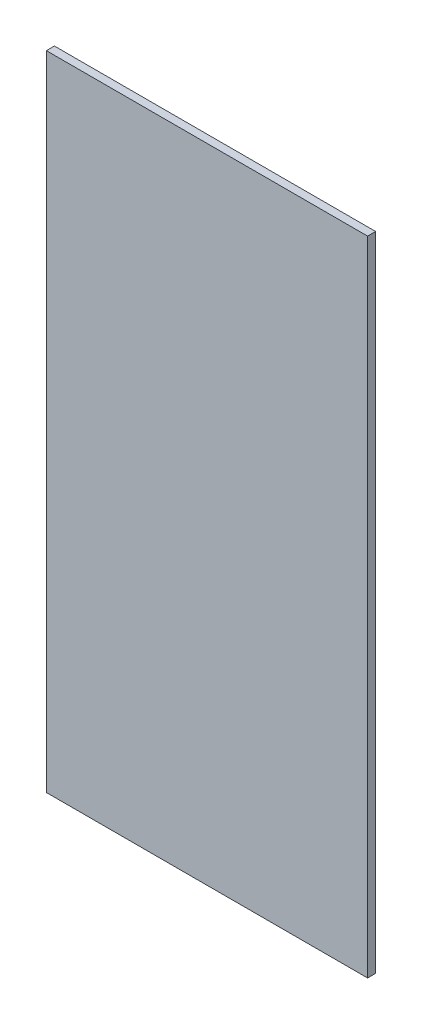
ISO-10303-21;
HEADER;
FILE_DESCRIPTION(('STEP AP214'),'2;1');
FILE_NAME('part.step','',(''),(''),'','','');
FILE_SCHEMA(('AUTOMOTIVE_DESIGN { 1 0 10303 214 1 1 1 1 }'));
ENDSEC;
DATA;
#1=APPLICATION_CONTEXT('core data for automotive mechanical design processes');
#2=APPLICATION_PROTOCOL_DEFINITION('international standard','automotive_design',2000,#1);
#3=PRODUCT_CONTEXT('',#1,'mechanical');
#4=PRODUCT('Part','Part','',(#3));
#5=PRODUCT_RELATED_PRODUCT_CATEGORY('part','',(#4));
#6=PRODUCT_DEFINITION_FORMATION('','',#4);
#7=PRODUCT_DEFINITION_CONTEXT('part definition',#1,'design');
#8=PRODUCT_DEFINITION('design','',#6,#7);
#9=PRODUCT_DEFINITION_SHAPE('','',#8);
#10=(LENGTH_UNIT() NAMED_UNIT(*) SI_UNIT(.MILLI.,.METRE.));
#11=(NAMED_UNIT(*) PLANE_ANGLE_UNIT() SI_UNIT($,.RADIAN.));
#12=(NAMED_UNIT(*) SI_UNIT($,.STERADIAN.) SOLID_ANGLE_UNIT());
#13=UNCERTAINTY_MEASURE_WITH_UNIT(LENGTH_MEASURE(1.E-05),#10,'distance_accuracy_value','');
#14=(GEOMETRIC_REPRESENTATION_CONTEXT(3) GLOBAL_UNCERTAINTY_ASSIGNED_CONTEXT((#13)) GLOBAL_UNIT_ASSIGNED_CONTEXT((#10,
#11,#12)) REPRESENTATION_CONTEXT('',''));
#15=CARTESIAN_POINT('',(0.,0.,0.));
#16=DIRECTION('',(0.,0.,1.));
#17=DIRECTION('',(1.,0.,0.));
#18=AXIS2_PLACEMENT_3D('',#15,#16,#17);
#19=CARTESIAN_POINT('',(-1007.50000000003,-1780.,-17.4999999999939));
#20=DIRECTION('',(0.,-1.,0.));
#21=DIRECTION('',(-1.,0.,0.));
#22=AXIS2_PLACEMENT_3D('',#19,#20,#21);
#23=CYLINDRICAL_SURFACE('',#22,2.5);
#24=DIRECTION('',(0.,-1.,0.));
#25=VECTOR('',#24,1.);
#26=CARTESIAN_POINT('',(-1007.50000000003,-1780.,-14.9999999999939));
#27=LINE('',#26,#25);
#28=CARTESIAN_POINT('',(-1007.50000000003,-1820.,-14.9999999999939));
#29=VERTEX_POINT('',#28);
#30=CARTESIAN_POINT('',(-1007.50000000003,-1840.,-14.9999999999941));
#31=VERTEX_POINT('',#30);
#32=EDGE_CURVE('P0_E151',#29,#31,#27,.T.);
#33=ORIENTED_EDGE('',*,*,#32,.T.);
#34=CARTESIAN_POINT('',(-1007.50000000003,-1840.,-17.4999999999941));
#35=DIRECTION('',(0.,-1.,0.));
#36=DIRECTION('',(-1.,0.,0.));
#37=AXIS2_PLACEMENT_3D('',#34,#35,#36);
#38=CIRCLE('',#37,2.5);
#39=CARTESIAN_POINT('',(-1005.50000000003,-1840.,-15.999999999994));
#40=VERTEX_POINT('',#39);
#41=EDGE_CURVE('P0_E12',#31,#40,#38,.T.);
#42=ORIENTED_EDGE('',*,*,#41,.T.);
#43=DIRECTION('',(0.,-1.,0.));
#44=VECTOR('',#43,1.);
#45=CARTESIAN_POINT('',(-1005.50000000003,-1780.,-15.9999999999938));
#46=LINE('',#45,#44);
#47=CARTESIAN_POINT('',(-1005.50000000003,-1820.,-15.9999999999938));
#48=VERTEX_POINT('',#47);
#49=EDGE_CURVE('P0_E198',#48,#40,#46,.T.);
#50=ORIENTED_EDGE('',*,*,#49,.F.);
#51=CARTESIAN_POINT('',(-1007.50000000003,-1820.,-17.4999999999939));
#52=DIRECTION('',(0.,1.,0.));
#53=DIRECTION('',(1.,0.,0.));
#54=AXIS2_PLACEMENT_3D('',#51,#52,#53);
#55=CIRCLE('',#54,2.5);
#56=EDGE_CURVE('P0_E153',#48,#29,#55,.T.);
#57=ORIENTED_EDGE('',*,*,#56,.T.);
#58=EDGE_LOOP('',(#33,#42,#50,#57));
#59=FACE_BOUND('',#58,.T.);
#60=ADVANCED_FACE('P0_F49',(#59),#23,.F.);
#61=CARTESIAN_POINT('',(-1007.50000000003,-1780.,-17.4999999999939));
#62=DIRECTION('',(0.,-1.,0.));
#63=DIRECTION('',(-1.,0.,0.));
#64=AXIS2_PLACEMENT_3D('',#61,#62,#63);
#65=CYLINDRICAL_SURFACE('',#64,5.);
#66=CARTESIAN_POINT('',(-1007.50000000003,-1820.,-17.4999999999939));
#67=DIRECTION('',(0.,1.,0.));
#68=DIRECTION('',(1.,0.,0.));
#69=AXIS2_PLACEMENT_3D('',#66,#67,#68);
#70=CIRCLE('',#69,5.);
#71=CARTESIAN_POINT('',(-1002.73030399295,-1820.,-15.9999999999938));
#72=VERTEX_POINT('',#71);
#73=CARTESIAN_POINT('',(-1007.50000000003,-1820.,-12.499999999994));
#74=VERTEX_POINT('',#73);
#75=EDGE_CURVE('P0_E152',#72,#74,#70,.T.);
#76=ORIENTED_EDGE('',*,*,#75,.F.);
#77=DIRECTION('',(0.,-1.,0.));
#78=VECTOR('',#77,1.);
#79=CARTESIAN_POINT('',(-1002.73030399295,-1780.,-15.9999999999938));
#80=LINE('',#79,#78);
#81=CARTESIAN_POINT('',(-1002.73030399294,-1860.,-15.999999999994));
#82=VERTEX_POINT('',#81);
#83=EDGE_CURVE('P0_E195',#72,#82,#80,.T.);
#84=ORIENTED_EDGE('',*,*,#83,.T.);
#85=CARTESIAN_POINT('',(-1007.50000000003,-1860.,-17.4999999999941));
#86=DIRECTION('',(0.,1.,0.));
#87=DIRECTION('',(1.,0.,0.));
#88=AXIS2_PLACEMENT_3D('',#85,#86,#87);
#89=CIRCLE('',#88,5.);
#90=CARTESIAN_POINT('',(-1007.50000000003,-1860.,-12.4999999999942));
#91=VERTEX_POINT('',#90);
#92=EDGE_CURVE('P0_E175',#82,#91,#89,.T.);
#93=ORIENTED_EDGE('',*,*,#92,.T.);
#94=DIRECTION('',(0.,-1.,0.));
#95=VECTOR('',#94,1.);
#96=CARTESIAN_POINT('',(-1007.50000000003,-1780.,-12.499999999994));
#97=LINE('',#96,#95);
#98=EDGE_CURVE('P0_E209',#74,#91,#97,.T.);
#99=ORIENTED_EDGE('',*,*,#98,.F.);
#100=EDGE_LOOP('',(#76,#84,#93,#99));
#101=FACE_BOUND('',#100,.T.);
#102=ADVANCED_FACE('P0_F220',(#101),#65,.T.);
#103=ORIENTED_EDGE('',*,*,#41,.F.);
#104=CARTESIAN_POINT('',(-1007.50000000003,-1860.,-14.9999999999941));
#105=VERTEX_POINT('',#104);
#106=EDGE_CURVE('P0_E201',#31,#105,#27,.T.);
#107=ORIENTED_EDGE('',*,*,#106,.T.);
#108=CARTESIAN_POINT('',(-1007.50000000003,-1860.,-17.4999999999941));
#109=DIRECTION('',(0.,1.,0.));
#110=DIRECTION('',(1.,0.,0.));
#111=AXIS2_PLACEMENT_3D('',#108,#109,#110);
#112=CIRCLE('',#111,2.5);
#113=CARTESIAN_POINT('',(-1005.50000000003,-1860.,-15.999999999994));
#114=VERTEX_POINT('',#113);
#115=EDGE_CURVE('P0_E170',#114,#105,#112,.T.);
#116=ORIENTED_EDGE('',*,*,#115,.F.);
#117=EDGE_CURVE('P0_E197',#40,#114,#46,.T.);
#118=ORIENTED_EDGE('',*,*,#117,.F.);
#119=EDGE_LOOP('',(#103,#107,#116,#118));
#120=FACE_BOUND('',#119,.T.);
#121=ADVANCED_FACE('P0_F222',(#120),#23,.F.);
#122=CARTESIAN_POINT('',(-1002.73030399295,-1780.,-15.9999999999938));
#123=DIRECTION('',(0.,0.,1.));
#124=DIRECTION('',(1.,0.,0.));
#125=AXIS2_PLACEMENT_3D('',#122,#123,#124);
#126=PLANE('',#125);
#127=ORIENTED_EDGE('',*,*,#83,.F.);
#128=DIRECTION('',(-1.,0.,0.));
#129=VECTOR('',#128,1.);
#130=CARTESIAN_POINT('',(-1002.73030399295,-1820.,-15.9999999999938));
#131=LINE('',#130,#129);
#132=EDGE_CURVE('P0_E58',#72,#48,#131,.T.);
#133=ORIENTED_EDGE('',*,*,#132,.T.);
#134=ORIENTED_EDGE('',*,*,#49,.T.);
#135=ORIENTED_EDGE('',*,*,#117,.T.);
#136=DIRECTION('',(-1.,0.,0.));
#137=VECTOR('',#136,1.);
#138=CARTESIAN_POINT('',(-1002.73030399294,-1860.,-15.999999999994));
#139=LINE('',#138,#137);
#140=EDGE_CURVE('P0_E211',#82,#114,#139,.T.);
#141=ORIENTED_EDGE('',*,*,#140,.F.);
#142=EDGE_LOOP('',(#127,#133,#134,#135,#141));
#143=FACE_BOUND('',#142,.T.);
#144=ADVANCED_FACE('P0_F216',(#143),#126,.T.);
#145=CARTESIAN_POINT('',(-1007.50000000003,-1900.,-17.4999999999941));
#146=DIRECTION('',(0.,1.,0.));
#147=DIRECTION('',(1.,0.,0.));
#148=AXIS2_PLACEMENT_3D('',#145,#146,#147);
#149=PLANE('',#148);
#150=DIRECTION('',(0.,0.,1.));
#151=VECTOR('',#150,1.);
#152=CARTESIAN_POINT('',(-1000.00000000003,-1900.,-48.6936528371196));
#153=LINE('',#152,#151);
#154=CARTESIAN_POINT('',(-1000.00000000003,-1900.,-14.9999999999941));
#155=VERTEX_POINT('',#154);
#156=CARTESIAN_POINT('',(-1000.00000000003,-1900.,-12.4999999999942));
#157=VERTEX_POINT('',#156);
#158=EDGE_CURVE('P0_E160',#155,#157,#153,.T.);
#159=ORIENTED_EDGE('',*,*,#158,.F.);
#160=DIRECTION('',(1.,0.,0.));
#161=VECTOR('',#160,1.);
#162=CARTESIAN_POINT('',(-1007.50000000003,-1900.,-14.9999999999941));
#163=LINE('',#162,#161);
#164=CARTESIAN_POINT('',(-947.500000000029,-1900.,-14.9999999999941));
#165=VERTEX_POINT('',#164);
#166=EDGE_CURVE('P0_E186',#155,#165,#163,.T.);
#167=ORIENTED_EDGE('',*,*,#166,.T.);
#168=DIRECTION('',(0.,0.,-1.));
#169=VECTOR('',#168,1.);
#170=CARTESIAN_POINT('',(-947.500000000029,-1900.,-12.4999999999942));
#171=LINE('',#170,#169);
#172=CARTESIAN_POINT('',(-947.500000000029,-1900.,-12.4999999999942));
#173=VERTEX_POINT('',#172);
#174=EDGE_CURVE('P0_E183',#173,#165,#171,.T.);
#175=ORIENTED_EDGE('',*,*,#174,.F.);
#176=DIRECTION('',(1.,0.,0.));
#177=VECTOR('',#176,1.);
#178=CARTESIAN_POINT('',(-1007.50000000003,-1900.,-12.4999999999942));
#179=LINE('',#178,#177);
#180=EDGE_CURVE('P0_E181',#157,#173,#179,.T.);
#181=ORIENTED_EDGE('',*,*,#180,.F.);
#182=EDGE_LOOP('',(#159,#167,#175,#181));
#183=FACE_BOUND('',#182,.T.);
#184=ADVANCED_FACE('P0_F234',(#183),#149,.F.);
#185=CARTESIAN_POINT('',(-1007.50000000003,-1780.,-12.499999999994));
#186=DIRECTION('',(0.,0.,-1.));
#187=DIRECTION('',(0.,1.,0.));
#188=AXIS2_PLACEMENT_3D('',#185,#186,#187);
#189=PLANE('',#188);
#190=DIRECTION('',(1.,0.,0.));
#191=VECTOR('',#190,1.);
#192=CARTESIAN_POINT('',(-1007.50000000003,-1780.,-12.499999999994));
#193=LINE('',#192,#191);
#194=CARTESIAN_POINT('',(-1000.00000000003,-1780.,-12.499999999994));
#195=VERTEX_POINT('',#194);
#196=CARTESIAN_POINT('',(-947.500000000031,-1780.,-12.499999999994));
#197=VERTEX_POINT('',#196);
#198=EDGE_CURVE('P0_E188',#195,#197,#193,.T.);
#199=ORIENTED_EDGE('',*,*,#198,.F.);
#200=DIRECTION('',(0.,-1.,0.));
#201=VECTOR('',#200,1.);
#202=CARTESIAN_POINT('',(-1000.00000000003,-1780.,-12.499999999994));
#203=LINE('',#202,#201);
#204=CARTESIAN_POINT('',(-1000.00000000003,-1820.,-12.499999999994));
#205=VERTEX_POINT('',#204);
#206=EDGE_CURVE('P0_E140',#195,#205,#203,.T.);
#207=ORIENTED_EDGE('',*,*,#206,.T.);
#208=DIRECTION('',(1.,0.,0.));
#209=VECTOR('',#208,1.);
#210=CARTESIAN_POINT('',(-1007.50000000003,-1820.,-12.499999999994));
#211=LINE('',#210,#209);
#212=EDGE_CURVE('P0_E147',#74,#205,#211,.T.);
#213=ORIENTED_EDGE('',*,*,#212,.F.);
#214=ORIENTED_EDGE('',*,*,#98,.T.);
#215=DIRECTION('',(1.,0.,0.));
#216=VECTOR('',#215,1.);
#217=CARTESIAN_POINT('',(-1007.50000000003,-1860.,-12.4999999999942));
#218=LINE('',#217,#216);
#219=CARTESIAN_POINT('',(-1000.00000000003,-1860.,-12.4999999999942));
#220=VERTEX_POINT('',#219);
#221=EDGE_CURVE('P0_E178',#91,#220,#218,.T.);
#222=ORIENTED_EDGE('',*,*,#221,.T.);
#223=DIRECTION('',(0.,1.,0.));
#224=VECTOR('',#223,1.);
#225=CARTESIAN_POINT('',(-1000.00000000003,-1780.,-12.499999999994));
#226=LINE('',#225,#224);
#227=EDGE_CURVE('P0_E168',#157,#220,#226,.T.);
#228=ORIENTED_EDGE('',*,*,#227,.F.);
#229=ORIENTED_EDGE('',*,*,#180,.T.);
#230=DIRECTION('',(0.,-1.,0.));
#231=VECTOR('',#230,1.);
#232=CARTESIAN_POINT('',(-947.500000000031,-1780.,-12.499999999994));
#233=LINE('',#232,#231);
#234=EDGE_CURVE('P0_E206',#197,#173,#233,.T.);
#235=ORIENTED_EDGE('',*,*,#234,.F.);
#236=EDGE_LOOP('',(#199,#207,#213,#214,#222,#228,#229,#235));
#237=FACE_BOUND('',#236,.T.);
#238=ADVANCED_FACE('P0_F51',(#237),#189,.F.);
#239=CARTESIAN_POINT('',(-947.500000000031,-1780.,-12.499999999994));
#240=DIRECTION('',(-1.,0.,0.));
#241=DIRECTION('',(0.,1.,0.));
#242=AXIS2_PLACEMENT_3D('',#239,#240,#241);
#243=PLANE('',#242);
#244=DIRECTION('',(0.,-1.,0.));
#245=VECTOR('',#244,1.);
#246=CARTESIAN_POINT('',(-947.500000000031,-1780.,-14.9999999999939));
#247=LINE('',#246,#245);
#248=CARTESIAN_POINT('',(-947.500000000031,-1780.,-14.9999999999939));
#249=VERTEX_POINT('',#248);
#250=EDGE_CURVE('P0_E203',#249,#165,#247,.T.);
#251=ORIENTED_EDGE('',*,*,#250,.F.);
#252=DIRECTION('',(0.,0.,-1.));
#253=VECTOR('',#252,1.);
#254=CARTESIAN_POINT('',(-947.500000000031,-1780.,-12.499999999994));
#255=LINE('',#254,#253);
#256=EDGE_CURVE('P0_E190',#197,#249,#255,.T.);
#257=ORIENTED_EDGE('',*,*,#256,.F.);
#258=ORIENTED_EDGE('',*,*,#234,.T.);
#259=ORIENTED_EDGE('',*,*,#174,.T.);
#260=EDGE_LOOP('',(#251,#257,#258,#259));
#261=FACE_BOUND('',#260,.T.);
#262=ADVANCED_FACE('P0_F290',(#261),#243,.F.);
#263=CARTESIAN_POINT('',(-1007.50000000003,-1780.,-14.9999999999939));
#264=DIRECTION('',(0.,0.,-1.));
#265=DIRECTION('',(0.,1.,0.));
#266=AXIS2_PLACEMENT_3D('',#263,#264,#265);
#267=PLANE('',#266);
#268=DIRECTION('',(0.,-1.,0.));
#269=VECTOR('',#268,1.);
#270=CARTESIAN_POINT('',(-1000.00000000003,-1780.,-14.9999999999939));
#271=LINE('',#270,#269);
#272=CARTESIAN_POINT('',(-1000.00000000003,-1780.,-14.9999999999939));
#273=VERTEX_POINT('',#272);
#274=CARTESIAN_POINT('',(-1000.00000000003,-1820.,-14.9999999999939));
#275=VERTEX_POINT('',#274);
#276=EDGE_CURVE('P0_E130',#273,#275,#271,.T.);
#277=ORIENTED_EDGE('',*,*,#276,.F.);
#278=DIRECTION('',(1.,0.,0.));
#279=VECTOR('',#278,1.);
#280=CARTESIAN_POINT('',(-1007.50000000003,-1780.,-14.9999999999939));
#281=LINE('',#280,#279);
#282=EDGE_CURVE('P0_E193',#273,#249,#281,.T.);
#283=ORIENTED_EDGE('',*,*,#282,.T.);
#284=ORIENTED_EDGE('',*,*,#250,.T.);
#285=ORIENTED_EDGE('',*,*,#166,.F.);
#286=DIRECTION('',(0.,1.,0.));
#287=VECTOR('',#286,1.);
#288=CARTESIAN_POINT('',(-1000.00000000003,-1780.,-14.9999999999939));
#289=LINE('',#288,#287);
#290=CARTESIAN_POINT('',(-1000.00000000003,-1860.,-14.9999999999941));
#291=VERTEX_POINT('',#290);
#292=EDGE_CURVE('P0_E165',#155,#291,#289,.T.);
#293=ORIENTED_EDGE('',*,*,#292,.T.);
#294=DIRECTION('',(1.,0.,0.));
#295=VECTOR('',#294,1.);
#296=CARTESIAN_POINT('',(-1007.50000000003,-1860.,-14.9999999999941));
#297=LINE('',#296,#295);
#298=EDGE_CURVE('P0_E173',#105,#291,#297,.T.);
#299=ORIENTED_EDGE('',*,*,#298,.F.);
#300=ORIENTED_EDGE('',*,*,#106,.F.);
#301=ORIENTED_EDGE('',*,*,#32,.F.);
#302=DIRECTION('',(1.,0.,0.));
#303=VECTOR('',#302,1.);
#304=CARTESIAN_POINT('',(-1007.50000000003,-1820.,-14.9999999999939));
#305=LINE('',#304,#303);
#306=EDGE_CURVE('P0_E144',#29,#275,#305,.T.);
#307=ORIENTED_EDGE('',*,*,#306,.T.);
#308=EDGE_LOOP('',(#277,#283,#284,#285,#293,#299,#300,#301,#307));
#309=FACE_BOUND('',#308,.T.);
#310=ADVANCED_FACE('P0_F150',(#309),#267,.T.);
#311=CARTESIAN_POINT('',(-1007.50000000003,-1780.,-17.4999999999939));
#312=DIRECTION('',(0.,1.,0.));
#313=DIRECTION('',(1.,0.,0.));
#314=AXIS2_PLACEMENT_3D('',#311,#312,#313);
#315=PLANE('',#314);
#316=DIRECTION('',(0.,0.,1.));
#317=VECTOR('',#316,1.);
#318=CARTESIAN_POINT('',(-1000.00000000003,-1780.,-48.6936528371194));
#319=LINE('',#318,#317);
#320=EDGE_CURVE('P0_E136',#273,#195,#319,.T.);
#321=ORIENTED_EDGE('',*,*,#320,.T.);
#322=ORIENTED_EDGE('',*,*,#198,.T.);
#323=ORIENTED_EDGE('',*,*,#256,.T.);
#324=ORIENTED_EDGE('',*,*,#282,.F.);
#325=EDGE_LOOP('',(#321,#322,#323,#324));
#326=FACE_BOUND('',#325,.T.);
#327=ADVANCED_FACE('P0_F241',(#326),#315,.T.);
#328=CARTESIAN_POINT('',(-1000.00000000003,-1860.,-48.6936528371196));
#329=DIRECTION('',(0.,1.,0.));
#330=DIRECTION('',(1.,0.,0.));
#331=AXIS2_PLACEMENT_3D('',#328,#329,#330);
#332=PLANE('',#331);
#333=ORIENTED_EDGE('',*,*,#92,.F.);
#334=ORIENTED_EDGE('',*,*,#140,.T.);
#335=ORIENTED_EDGE('',*,*,#115,.T.);
#336=ORIENTED_EDGE('',*,*,#298,.T.);
#337=DIRECTION('',(0.,0.,1.));
#338=VECTOR('',#337,1.);
#339=CARTESIAN_POINT('',(-1000.00000000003,-1860.,-48.6936528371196));
#340=LINE('',#339,#338);
#341=EDGE_CURVE('P0_E162',#291,#220,#340,.T.);
#342=ORIENTED_EDGE('',*,*,#341,.T.);
#343=ORIENTED_EDGE('',*,*,#221,.F.);
#344=EDGE_LOOP('',(#333,#334,#335,#336,#342,#343));
#345=FACE_BOUND('',#344,.T.);
#346=ADVANCED_FACE('P0_F243',(#345),#332,.F.);
#347=CARTESIAN_POINT('',(-1000.00000000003,-1860.,-48.6936528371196));
#348=DIRECTION('',(-1.,0.,0.));
#349=DIRECTION('',(0.,1.,0.));
#350=AXIS2_PLACEMENT_3D('',#347,#348,#349);
#351=PLANE('',#350);
#352=ORIENTED_EDGE('',*,*,#227,.T.);
#353=ORIENTED_EDGE('',*,*,#341,.F.);
#354=ORIENTED_EDGE('',*,*,#292,.F.);
#355=ORIENTED_EDGE('',*,*,#158,.T.);
#356=EDGE_LOOP('',(#352,#353,#354,#355));
#357=FACE_BOUND('',#356,.T.);
#358=ADVANCED_FACE('P0_F248',(#357),#351,.T.);
#359=CARTESIAN_POINT('',(-1000.00000000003,-1820.,-48.6936528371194));
#360=DIRECTION('',(0.,1.,0.));
#361=DIRECTION('',(1.,0.,0.));
#362=AXIS2_PLACEMENT_3D('',#359,#360,#361);
#363=PLANE('',#362);
#364=ORIENTED_EDGE('',*,*,#212,.T.);
#365=DIRECTION('',(0.,0.,1.));
#366=VECTOR('',#365,1.);
#367=CARTESIAN_POINT('',(-1000.00000000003,-1820.,-48.6936528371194));
#368=LINE('',#367,#366);
#369=EDGE_CURVE('P0_E133',#275,#205,#368,.T.);
#370=ORIENTED_EDGE('',*,*,#369,.F.);
#371=ORIENTED_EDGE('',*,*,#306,.F.);
#372=ORIENTED_EDGE('',*,*,#56,.F.);
#373=ORIENTED_EDGE('',*,*,#132,.F.);
#374=ORIENTED_EDGE('',*,*,#75,.T.);
#375=EDGE_LOOP('',(#364,#370,#371,#372,#373,#374));
#376=FACE_BOUND('',#375,.T.);
#377=ADVANCED_FACE('P0_F143',(#376),#363,.T.);
#378=CARTESIAN_POINT('',(-1000.00000000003,-1820.,-48.6936528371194));
#379=DIRECTION('',(1.,0.,0.));
#380=DIRECTION('',(0.,-1.,0.));
#381=AXIS2_PLACEMENT_3D('',#378,#379,#380);
#382=PLANE('',#381);
#383=ORIENTED_EDGE('',*,*,#320,.F.);
#384=ORIENTED_EDGE('',*,*,#276,.T.);
#385=ORIENTED_EDGE('',*,*,#369,.T.);
#386=ORIENTED_EDGE('',*,*,#206,.F.);
#387=EDGE_LOOP('',(#383,#384,#385,#386));
#388=FACE_BOUND('',#387,.T.);
#389=ADVANCED_FACE('P0_F132',(#388),#382,.F.);
#390=CLOSED_SHELL('',(#60,#102,#121,#144,#184,#238,#262,#310,#327,#346,#358,#377,#389));
#391=MANIFOLD_SOLID_BREP('P0_B2',#390);
#392=CARTESIAN_POINT('',(-1007.50000000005,-100.000000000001,-17.4999999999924));
#393=DIRECTION('',(0.,-1.,0.));
#394=DIRECTION('',(-1.,0.,0.));
#395=AXIS2_PLACEMENT_3D('',#392,#393,#394);
#396=CYLINDRICAL_SURFACE('',#395,2.5);
#397=DIRECTION('',(0.,-1.,0.));
#398=VECTOR('',#397,1.);
#399=CARTESIAN_POINT('',(-1007.50000000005,-100.000000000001,-14.9999999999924));
#400=LINE('',#399,#398);
#401=CARTESIAN_POINT('',(-1007.50000000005,-140.000000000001,-14.9999999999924));
#402=VERTEX_POINT('',#401);
#403=CARTESIAN_POINT('',(-1007.50000000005,-160.000000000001,-14.9999999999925));
#404=VERTEX_POINT('',#403);
#405=EDGE_CURVE('P0_E463',#402,#404,#400,.T.);
#406=ORIENTED_EDGE('',*,*,#405,.T.);
#407=CARTESIAN_POINT('',(-1007.50000000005,-160.000000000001,-17.4999999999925));
#408=DIRECTION('',(0.,-1.,0.));
#409=DIRECTION('',(-1.,0.,0.));
#410=AXIS2_PLACEMENT_3D('',#407,#408,#409);
#411=CIRCLE('',#410,2.5);
#412=CARTESIAN_POINT('',(-1005.50000000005,-160.000000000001,-15.9999999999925));
#413=VERTEX_POINT('',#412);
#414=EDGE_CURVE('P0_E47',#404,#413,#411,.T.);
#415=ORIENTED_EDGE('',*,*,#414,.T.);
#416=DIRECTION('',(0.,-1.,0.));
#417=VECTOR('',#416,1.);
#418=CARTESIAN_POINT('',(-1005.50000000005,-100.000000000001,-15.9999999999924));
#419=LINE('',#418,#417);
#420=CARTESIAN_POINT('',(-1005.50000000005,-140.000000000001,-15.9999999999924));
#421=VERTEX_POINT('',#420);
#422=EDGE_CURVE('P0_E510',#421,#413,#419,.T.);
#423=ORIENTED_EDGE('',*,*,#422,.F.);
#424=CARTESIAN_POINT('',(-1007.50000000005,-140.000000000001,-17.4999999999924));
#425=DIRECTION('',(0.,1.,0.));
#426=DIRECTION('',(1.,0.,0.));
#427=AXIS2_PLACEMENT_3D('',#424,#425,#426);
#428=CIRCLE('',#427,2.5);
#429=EDGE_CURVE('P0_E465',#421,#402,#428,.T.);
#430=ORIENTED_EDGE('',*,*,#429,.T.);
#431=EDGE_LOOP('',(#406,#415,#423,#430));
#432=FACE_BOUND('',#431,.T.);
#433=ADVANCED_FACE('P0_F361',(#432),#396,.F.);
#434=CARTESIAN_POINT('',(-1007.50000000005,-100.000000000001,-17.4999999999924));
#435=DIRECTION('',(0.,-1.,0.));
#436=DIRECTION('',(-1.,0.,0.));
#437=AXIS2_PLACEMENT_3D('',#434,#435,#436);
#438=CYLINDRICAL_SURFACE('',#437,5.);
#439=CARTESIAN_POINT('',(-1007.50000000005,-140.000000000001,-17.4999999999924));
#440=DIRECTION('',(0.,1.,0.));
#441=DIRECTION('',(1.,0.,0.));
#442=AXIS2_PLACEMENT_3D('',#439,#440,#441);
#443=CIRCLE('',#442,5.);
#444=CARTESIAN_POINT('',(-1002.73030399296,-140.000000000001,-15.9999999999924));
#445=VERTEX_POINT('',#444);
#446=CARTESIAN_POINT('',(-1007.50000000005,-140.000000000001,-12.4999999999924));
#447=VERTEX_POINT('',#446);
#448=EDGE_CURVE('P0_E464',#445,#447,#443,.T.);
#449=ORIENTED_EDGE('',*,*,#448,.F.);
#450=DIRECTION('',(0.,-1.,0.));
#451=VECTOR('',#450,1.);
#452=CARTESIAN_POINT('',(-1002.73030399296,-100.000000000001,-15.9999999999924));
#453=LINE('',#452,#451);
#454=CARTESIAN_POINT('',(-1002.73030399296,-180.000000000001,-15.9999999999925));
#455=VERTEX_POINT('',#454);
#456=EDGE_CURVE('P0_E507',#445,#455,#453,.T.);
#457=ORIENTED_EDGE('',*,*,#456,.T.);
#458=CARTESIAN_POINT('',(-1007.50000000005,-180.000000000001,-17.4999999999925));
#459=DIRECTION('',(0.,1.,0.));
#460=DIRECTION('',(1.,0.,0.));
#461=AXIS2_PLACEMENT_3D('',#458,#459,#460);
#462=CIRCLE('',#461,5.);
#463=CARTESIAN_POINT('',(-1007.50000000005,-180.000000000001,-12.4999999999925));
#464=VERTEX_POINT('',#463);
#465=EDGE_CURVE('P0_E487',#455,#464,#462,.T.);
#466=ORIENTED_EDGE('',*,*,#465,.T.);
#467=DIRECTION('',(0.,-1.,0.));
#468=VECTOR('',#467,1.);
#469=CARTESIAN_POINT('',(-1007.50000000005,-100.000000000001,-12.4999999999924));
#470=LINE('',#469,#468);
#471=EDGE_CURVE('P0_E521',#447,#464,#470,.T.);
#472=ORIENTED_EDGE('',*,*,#471,.F.);
#473=EDGE_LOOP('',(#449,#457,#466,#472));
#474=FACE_BOUND('',#473,.T.);
#475=ADVANCED_FACE('P0_F532',(#474),#438,.T.);
#476=ORIENTED_EDGE('',*,*,#414,.F.);
#477=CARTESIAN_POINT('',(-1007.50000000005,-180.000000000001,-14.9999999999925));
#478=VERTEX_POINT('',#477);
#479=EDGE_CURVE('P0_E513',#404,#478,#400,.T.);
#480=ORIENTED_EDGE('',*,*,#479,.T.);
#481=CARTESIAN_POINT('',(-1007.50000000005,-180.000000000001,-17.4999999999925));
#482=DIRECTION('',(0.,1.,0.));
#483=DIRECTION('',(1.,0.,0.));
#484=AXIS2_PLACEMENT_3D('',#481,#482,#483);
#485=CIRCLE('',#484,2.5);
#486=CARTESIAN_POINT('',(-1005.50000000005,-180.000000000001,-15.9999999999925));
#487=VERTEX_POINT('',#486);
#488=EDGE_CURVE('P0_E482',#487,#478,#485,.T.);
#489=ORIENTED_EDGE('',*,*,#488,.F.);
#490=EDGE_CURVE('P0_E509',#413,#487,#419,.T.);
#491=ORIENTED_EDGE('',*,*,#490,.F.);
#492=EDGE_LOOP('',(#476,#480,#489,#491));
#493=FACE_BOUND('',#492,.T.);
#494=ADVANCED_FACE('P0_F534',(#493),#396,.F.);
#495=CARTESIAN_POINT('',(-1002.73030399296,-100.000000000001,-15.9999999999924));
#496=DIRECTION('',(0.,0.,1.));
#497=DIRECTION('',(1.,0.,0.));
#498=AXIS2_PLACEMENT_3D('',#495,#496,#497);
#499=PLANE('',#498);
#500=ORIENTED_EDGE('',*,*,#456,.F.);
#501=DIRECTION('',(-1.,0.,0.));
#502=VECTOR('',#501,1.);
#503=CARTESIAN_POINT('',(-1002.73030399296,-140.000000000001,-15.9999999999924));
#504=LINE('',#503,#502);
#505=EDGE_CURVE('P0_E370',#445,#421,#504,.T.);
#506=ORIENTED_EDGE('',*,*,#505,.T.);
#507=ORIENTED_EDGE('',*,*,#422,.T.);
#508=ORIENTED_EDGE('',*,*,#490,.T.);
#509=DIRECTION('',(-1.,0.,0.));
#510=VECTOR('',#509,1.);
#511=CARTESIAN_POINT('',(-1002.73030399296,-180.000000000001,-15.9999999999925));
#512=LINE('',#511,#510);
#513=EDGE_CURVE('P0_E523',#455,#487,#512,.T.);
#514=ORIENTED_EDGE('',*,*,#513,.F.);
#515=EDGE_LOOP('',(#500,#506,#507,#508,#514));
#516=FACE_BOUND('',#515,.T.);
#517=ADVANCED_FACE('P0_F528',(#516),#499,.T.);
#518=CARTESIAN_POINT('',(-1007.50000000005,-220.000000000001,-17.4999999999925));
#519=DIRECTION('',(0.,1.,0.));
#520=DIRECTION('',(1.,0.,0.));
#521=AXIS2_PLACEMENT_3D('',#518,#519,#520);
#522=PLANE('',#521);
#523=DIRECTION('',(0.,0.,1.));
#524=VECTOR('',#523,1.);
#525=CARTESIAN_POINT('',(-1000.00000000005,-220.000000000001,-48.6936528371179));
#526=LINE('',#525,#524);
#527=CARTESIAN_POINT('',(-1000.00000000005,-220.000000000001,-14.9999999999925));
#528=VERTEX_POINT('',#527);
#529=CARTESIAN_POINT('',(-1000.00000000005,-220.000000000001,-12.4999999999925));
#530=VERTEX_POINT('',#529);
#531=EDGE_CURVE('P0_E472',#528,#530,#526,.T.);
#532=ORIENTED_EDGE('',*,*,#531,.F.);
#533=DIRECTION('',(1.,0.,0.));
#534=VECTOR('',#533,1.);
#535=CARTESIAN_POINT('',(-1007.50000000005,-220.000000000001,-14.9999999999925));
#536=LINE('',#535,#534);
#537=CARTESIAN_POINT('',(-947.500000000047,-220.,-14.9999999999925));
#538=VERTEX_POINT('',#537);
#539=EDGE_CURVE('P0_E498',#528,#538,#536,.T.);
#540=ORIENTED_EDGE('',*,*,#539,.T.);
#541=DIRECTION('',(0.,0.,-1.));
#542=VECTOR('',#541,1.);
#543=CARTESIAN_POINT('',(-947.500000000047,-220.,-12.4999999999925));
#544=LINE('',#543,#542);
#545=CARTESIAN_POINT('',(-947.500000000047,-220.,-12.4999999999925));
#546=VERTEX_POINT('',#545);
#547=EDGE_CURVE('P0_E495',#546,#538,#544,.T.);
#548=ORIENTED_EDGE('',*,*,#547,.F.);
#549=DIRECTION('',(1.,0.,0.));
#550=VECTOR('',#549,1.);
#551=CARTESIAN_POINT('',(-1007.50000000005,-220.000000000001,-12.4999999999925));
#552=LINE('',#551,#550);
#553=EDGE_CURVE('P0_E493',#530,#546,#552,.T.);
#554=ORIENTED_EDGE('',*,*,#553,.F.);
#555=EDGE_LOOP('',(#532,#540,#548,#554));
#556=FACE_BOUND('',#555,.T.);
#557=ADVANCED_FACE('P0_F546',(#556),#522,.F.);
#558=CARTESIAN_POINT('',(-1007.50000000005,-100.000000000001,-12.4999999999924));
#559=DIRECTION('',(0.,0.,-1.));
#560=DIRECTION('',(0.,1.,0.));
#561=AXIS2_PLACEMENT_3D('',#558,#559,#560);
#562=PLANE('',#561);
#563=DIRECTION('',(1.,0.,0.));
#564=VECTOR('',#563,1.);
#565=CARTESIAN_POINT('',(-1007.50000000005,-100.000000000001,-12.4999999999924));
#566=LINE('',#565,#564);
#567=CARTESIAN_POINT('',(-1000.00000000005,-100.000000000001,-12.4999999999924));
#568=VERTEX_POINT('',#567);
#569=CARTESIAN_POINT('',(-947.500000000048,-100.,-12.4999999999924));
#570=VERTEX_POINT('',#569);
#571=EDGE_CURVE('P0_E500',#568,#570,#566,.T.);
#572=ORIENTED_EDGE('',*,*,#571,.F.);
#573=DIRECTION('',(0.,-1.,0.));
#574=VECTOR('',#573,1.);
#575=CARTESIAN_POINT('',(-1000.00000000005,-100.000000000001,-12.4999999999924));
#576=LINE('',#575,#574);
#577=CARTESIAN_POINT('',(-1000.00000000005,-140.000000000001,-12.4999999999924));
#578=VERTEX_POINT('',#577);
#579=EDGE_CURVE('P0_E452',#568,#578,#576,.T.);
#580=ORIENTED_EDGE('',*,*,#579,.T.);
#581=DIRECTION('',(1.,0.,0.));
#582=VECTOR('',#581,1.);
#583=CARTESIAN_POINT('',(-1007.50000000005,-140.000000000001,-12.4999999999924));
#584=LINE('',#583,#582);
#585=EDGE_CURVE('P0_E459',#447,#578,#584,.T.);
#586=ORIENTED_EDGE('',*,*,#585,.F.);
#587=ORIENTED_EDGE('',*,*,#471,.T.);
#588=DIRECTION('',(1.,0.,0.));
#589=VECTOR('',#588,1.);
#590=CARTESIAN_POINT('',(-1007.50000000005,-180.000000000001,-12.4999999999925));
#591=LINE('',#590,#589);
#592=CARTESIAN_POINT('',(-1000.00000000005,-180.000000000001,-12.4999999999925));
#593=VERTEX_POINT('',#592);
#594=EDGE_CURVE('P0_E490',#464,#593,#591,.T.);
#595=ORIENTED_EDGE('',*,*,#594,.T.);
#596=DIRECTION('',(0.,1.,0.));
#597=VECTOR('',#596,1.);
#598=CARTESIAN_POINT('',(-1000.00000000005,-100.000000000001,-12.4999999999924));
#599=LINE('',#598,#597);
#600=EDGE_CURVE('P0_E480',#530,#593,#599,.T.);
#601=ORIENTED_EDGE('',*,*,#600,.F.);
#602=ORIENTED_EDGE('',*,*,#553,.T.);
#603=DIRECTION('',(0.,-1.,0.));
#604=VECTOR('',#603,1.);
#605=CARTESIAN_POINT('',(-947.500000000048,-100.,-12.4999999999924));
#606=LINE('',#605,#604);
#607=EDGE_CURVE('P0_E518',#570,#546,#606,.T.);
#608=ORIENTED_EDGE('',*,*,#607,.F.);
#609=EDGE_LOOP('',(#572,#580,#586,#587,#595,#601,#602,#608));
#610=FACE_BOUND('',#609,.T.);
#611=ADVANCED_FACE('P0_F363',(#610),#562,.F.);
#612=CARTESIAN_POINT('',(-947.500000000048,-100.,-12.4999999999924));
#613=DIRECTION('',(-1.,0.,0.));
#614=DIRECTION('',(0.,1.,0.));
#615=AXIS2_PLACEMENT_3D('',#612,#613,#614);
#616=PLANE('',#615);
#617=DIRECTION('',(0.,-1.,0.));
#618=VECTOR('',#617,1.);
#619=CARTESIAN_POINT('',(-947.500000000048,-100.,-14.9999999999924));
#620=LINE('',#619,#618);
#621=CARTESIAN_POINT('',(-947.500000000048,-100.,-14.9999999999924));
#622=VERTEX_POINT('',#621);
#623=EDGE_CURVE('P0_E515',#622,#538,#620,.T.);
#624=ORIENTED_EDGE('',*,*,#623,.F.);
#625=DIRECTION('',(0.,0.,-1.));
#626=VECTOR('',#625,1.);
#627=CARTESIAN_POINT('',(-947.500000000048,-100.,-12.4999999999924));
#628=LINE('',#627,#626);
#629=EDGE_CURVE('P0_E502',#570,#622,#628,.T.);
#630=ORIENTED_EDGE('',*,*,#629,.F.);
#631=ORIENTED_EDGE('',*,*,#607,.T.);
#632=ORIENTED_EDGE('',*,*,#547,.T.);
#633=EDGE_LOOP('',(#624,#630,#631,#632));
#634=FACE_BOUND('',#633,.T.);
#635=ADVANCED_FACE('P0_F602',(#634),#616,.F.);
#636=CARTESIAN_POINT('',(-1007.50000000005,-100.000000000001,-14.9999999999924));
#637=DIRECTION('',(0.,0.,-1.));
#638=DIRECTION('',(0.,1.,0.));
#639=AXIS2_PLACEMENT_3D('',#636,#637,#638);
#640=PLANE('',#639);
#641=DIRECTION('',(0.,-1.,0.));
#642=VECTOR('',#641,1.);
#643=CARTESIAN_POINT('',(-1000.00000000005,-100.000000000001,-14.9999999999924));
#644=LINE('',#643,#642);
#645=CARTESIAN_POINT('',(-1000.00000000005,-100.000000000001,-14.9999999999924));
#646=VERTEX_POINT('',#645);
#647=CARTESIAN_POINT('',(-1000.00000000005,-140.000000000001,-14.9999999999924));
#648=VERTEX_POINT('',#647);
#649=EDGE_CURVE('P0_E442',#646,#648,#644,.T.);
#650=ORIENTED_EDGE('',*,*,#649,.F.);
#651=DIRECTION('',(1.,0.,0.));
#652=VECTOR('',#651,1.);
#653=CARTESIAN_POINT('',(-1007.50000000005,-100.000000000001,-14.9999999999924));
#654=LINE('',#653,#652);
#655=EDGE_CURVE('P0_E505',#646,#622,#654,.T.);
#656=ORIENTED_EDGE('',*,*,#655,.T.);
#657=ORIENTED_EDGE('',*,*,#623,.T.);
#658=ORIENTED_EDGE('',*,*,#539,.F.);
#659=DIRECTION('',(0.,1.,0.));
#660=VECTOR('',#659,1.);
#661=CARTESIAN_POINT('',(-1000.00000000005,-100.000000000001,-14.9999999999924));
#662=LINE('',#661,#660);
#663=CARTESIAN_POINT('',(-1000.00000000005,-180.000000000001,-14.9999999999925));
#664=VERTEX_POINT('',#663);
#665=EDGE_CURVE('P0_E477',#528,#664,#662,.T.);
#666=ORIENTED_EDGE('',*,*,#665,.T.);
#667=DIRECTION('',(1.,0.,0.));
#668=VECTOR('',#667,1.);
#669=CARTESIAN_POINT('',(-1007.50000000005,-180.000000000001,-14.9999999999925));
#670=LINE('',#669,#668);
#671=EDGE_CURVE('P0_E485',#478,#664,#670,.T.);
#672=ORIENTED_EDGE('',*,*,#671,.F.);
#673=ORIENTED_EDGE('',*,*,#479,.F.);
#674=ORIENTED_EDGE('',*,*,#405,.F.);
#675=DIRECTION('',(1.,0.,0.));
#676=VECTOR('',#675,1.);
#677=CARTESIAN_POINT('',(-1007.50000000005,-140.000000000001,-14.9999999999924));
#678=LINE('',#677,#676);
#679=EDGE_CURVE('P0_E456',#402,#648,#678,.T.);
#680=ORIENTED_EDGE('',*,*,#679,.T.);
#681=EDGE_LOOP('',(#650,#656,#657,#658,#666,#672,#673,#674,#680));
#682=FACE_BOUND('',#681,.T.);
#683=ADVANCED_FACE('P0_F462',(#682),#640,.T.);
#684=CARTESIAN_POINT('',(-1007.50000000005,-100.000000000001,-17.4999999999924));
#685=DIRECTION('',(0.,1.,0.));
#686=DIRECTION('',(1.,0.,0.));
#687=AXIS2_PLACEMENT_3D('',#684,#685,#686);
#688=PLANE('',#687);
#689=DIRECTION('',(0.,0.,1.));
#690=VECTOR('',#689,1.);
#691=CARTESIAN_POINT('',(-1000.00000000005,-100.000000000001,-48.6936528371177));
#692=LINE('',#691,#690);
#693=EDGE_CURVE('P0_E448',#646,#568,#692,.T.);
#694=ORIENTED_EDGE('',*,*,#693,.T.);
#695=ORIENTED_EDGE('',*,*,#571,.T.);
#696=ORIENTED_EDGE('',*,*,#629,.T.);
#697=ORIENTED_EDGE('',*,*,#655,.F.);
#698=EDGE_LOOP('',(#694,#695,#696,#697));
#699=FACE_BOUND('',#698,.T.);
#700=ADVANCED_FACE('P0_F553',(#699),#688,.T.);
#701=CARTESIAN_POINT('',(-1000.00000000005,-180.000000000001,-48.6936528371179));
#702=DIRECTION('',(0.,1.,0.));
#703=DIRECTION('',(1.,0.,0.));
#704=AXIS2_PLACEMENT_3D('',#701,#702,#703);
#705=PLANE('',#704);
#706=ORIENTED_EDGE('',*,*,#465,.F.);
#707=ORIENTED_EDGE('',*,*,#513,.T.);
#708=ORIENTED_EDGE('',*,*,#488,.T.);
#709=ORIENTED_EDGE('',*,*,#671,.T.);
#710=DIRECTION('',(0.,0.,1.));
#711=VECTOR('',#710,1.);
#712=CARTESIAN_POINT('',(-1000.00000000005,-180.000000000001,-48.6936528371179));
#713=LINE('',#712,#711);
#714=EDGE_CURVE('P0_E474',#664,#593,#713,.T.);
#715=ORIENTED_EDGE('',*,*,#714,.T.);
#716=ORIENTED_EDGE('',*,*,#594,.F.);
#717=EDGE_LOOP('',(#706,#707,#708,#709,#715,#716));
#718=FACE_BOUND('',#717,.T.);
#719=ADVANCED_FACE('P0_F555',(#718),#705,.F.);
#720=CARTESIAN_POINT('',(-1000.00000000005,-180.000000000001,-48.6936528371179));
#721=DIRECTION('',(-1.,0.,0.));
#722=DIRECTION('',(0.,1.,0.));
#723=AXIS2_PLACEMENT_3D('',#720,#721,#722);
#724=PLANE('',#723);
#725=ORIENTED_EDGE('',*,*,#600,.T.);
#726=ORIENTED_EDGE('',*,*,#714,.F.);
#727=ORIENTED_EDGE('',*,*,#665,.F.);
#728=ORIENTED_EDGE('',*,*,#531,.T.);
#729=EDGE_LOOP('',(#725,#726,#727,#728));
#730=FACE_BOUND('',#729,.T.);
#731=ADVANCED_FACE('P0_F560',(#730),#724,.T.);
#732=CARTESIAN_POINT('',(-1000.00000000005,-140.000000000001,-48.6936528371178));
#733=DIRECTION('',(0.,1.,0.));
#734=DIRECTION('',(1.,0.,0.));
#735=AXIS2_PLACEMENT_3D('',#732,#733,#734);
#736=PLANE('',#735);
#737=ORIENTED_EDGE('',*,*,#585,.T.);
#738=DIRECTION('',(0.,0.,1.));
#739=VECTOR('',#738,1.);
#740=CARTESIAN_POINT('',(-1000.00000000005,-140.000000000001,-48.6936528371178));
#741=LINE('',#740,#739);
#742=EDGE_CURVE('P0_E445',#648,#578,#741,.T.);
#743=ORIENTED_EDGE('',*,*,#742,.F.);
#744=ORIENTED_EDGE('',*,*,#679,.F.);
#745=ORIENTED_EDGE('',*,*,#429,.F.);
#746=ORIENTED_EDGE('',*,*,#505,.F.);
#747=ORIENTED_EDGE('',*,*,#448,.T.);
#748=EDGE_LOOP('',(#737,#743,#744,#745,#746,#747));
#749=FACE_BOUND('',#748,.T.);
#750=ADVANCED_FACE('P0_F455',(#749),#736,.T.);
#751=CARTESIAN_POINT('',(-1000.00000000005,-140.000000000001,-48.6936528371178));
#752=DIRECTION('',(1.,0.,0.));
#753=DIRECTION('',(0.,-1.,0.));
#754=AXIS2_PLACEMENT_3D('',#751,#752,#753);
#755=PLANE('',#754);
#756=ORIENTED_EDGE('',*,*,#693,.F.);
#757=ORIENTED_EDGE('',*,*,#649,.T.);
#758=ORIENTED_EDGE('',*,*,#742,.T.);
#759=ORIENTED_EDGE('',*,*,#579,.F.);
#760=EDGE_LOOP('',(#756,#757,#758,#759));
#761=FACE_BOUND('',#760,.T.);
#762=ADVANCED_FACE('P0_F444',(#761),#755,.F.);
#763=CLOSED_SHELL('',(#433,#475,#494,#517,#557,#611,#635,#683,#700,#719,#731,#750,#762));
#764=MANIFOLD_SOLID_BREP('P0_B6',#763);
#765=CARTESIAN_POINT('',(-1000.00000000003,-2000.,12.5000000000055));
#766=DIRECTION('',(-1.00000000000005,0.,0.));
#767=DIRECTION('',(0.,0.,1.00000000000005));
#768=AXIS2_PLACEMENT_3D('',#765,#766,#767);
#769=PLANE('',#768);
#770=DIRECTION('',(0.,0.,-1.00000000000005));
#771=VECTOR('',#770,1.);
#772=CARTESIAN_POINT('',(-1000.00000000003,-2000.,12.5000000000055));
#773=LINE('',#772,#771);
#774=CARTESIAN_POINT('',(-1000.00000000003,-2000.,12.5000000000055));
#775=VERTEX_POINT('',#774);
#776=CARTESIAN_POINT('',(-1000.00000000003,-1999.99999999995,-12.4999999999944));
#777=VERTEX_POINT('',#776);
#778=EDGE_CURVE('P1_E10',#775,#777,#773,.T.);
#779=ORIENTED_EDGE('',*,*,#778,.F.);
#780=DIRECTION('',(0.,1.,0.));
#781=VECTOR('',#780,1.);
#782=CARTESIAN_POINT('',(-1000.00000000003,-2000.,12.5000000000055));
#783=LINE('',#782,#781);
#784=CARTESIAN_POINT('',(-1000.00000000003,-1.33226762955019E-12,12.5000000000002));
#785=VERTEX_POINT('',#784);
#786=EDGE_CURVE('P1_E56',#775,#785,#783,.T.);
#787=ORIENTED_EDGE('',*,*,#786,.T.);
#788=DIRECTION('',(0.,0.,-1.00000000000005));
#789=VECTOR('',#788,1.);
#790=CARTESIAN_POINT('',(-1000.00000000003,-1.33226762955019E-12,12.5000000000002));
#791=LINE('',#790,#789);
#792=CARTESIAN_POINT('',(-1000.00000000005,-8.88178419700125E-13,-12.4999999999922));
#793=VERTEX_POINT('',#792);
#794=EDGE_CURVE('P1_E52',#785,#793,#791,.T.);
#795=ORIENTED_EDGE('',*,*,#794,.T.);
#796=DIRECTION('',(0.,1.,0.));
#797=VECTOR('',#796,1.);
#798=CARTESIAN_POINT('',(-1000.00000000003,-1999.99999999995,-12.4999999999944));
#799=LINE('',#798,#797);
#800=EDGE_CURVE('P1_E54',#777,#793,#799,.T.);
#801=ORIENTED_EDGE('',*,*,#800,.F.);
#802=EDGE_LOOP('',(#779,#787,#795,#801));
#803=FACE_BOUND('',#802,.T.);
#804=ADVANCED_FACE('P1_F15',(#803),#769,.T.);
#805=CARTESIAN_POINT('',(-1000.00000000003,-2000.,12.5000000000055));
#806=DIRECTION('',(0.,1.,0.));
#807=DIRECTION('',(0.,0.,1.00000000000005));
#808=AXIS2_PLACEMENT_3D('',#805,#806,#807);
#809=PLANE('',#808);
#810=DIRECTION('',(0.,0.,-1.00000000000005));
#811=VECTOR('',#810,1.);
#812=CARTESIAN_POINT('',(4.44089209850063E-13,-1999.99999999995,12.4999999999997));
#813=LINE('',#812,#811);
#814=CARTESIAN_POINT('',(4.44089209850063E-13,-1999.99999999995,12.4999999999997));
#815=VERTEX_POINT('',#814);
#816=CARTESIAN_POINT('',(6.21724893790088E-12,-1999.99999999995,-12.5000000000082));
#817=VERTEX_POINT('',#816);
#818=EDGE_CURVE('P1_E23',#815,#817,#813,.T.);
#819=ORIENTED_EDGE('',*,*,#818,.F.);
#820=DIRECTION('',(1.00000000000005,0.,0.));
#821=VECTOR('',#820,1.);
#822=CARTESIAN_POINT('',(-1000.00000000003,-2000.,12.5000000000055));
#823=LINE('',#822,#821);
#824=EDGE_CURVE('P1_E62',#775,#815,#823,.T.);
#825=ORIENTED_EDGE('',*,*,#824,.F.);
#826=ORIENTED_EDGE('',*,*,#778,.T.);
#827=DIRECTION('',(1.00000000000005,0.,0.));
#828=VECTOR('',#827,1.);
#829=CARTESIAN_POINT('',(-1000.00000000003,-1999.99999999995,-12.4999999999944));
#830=LINE('',#829,#828);
#831=EDGE_CURVE('P1_E70',#777,#817,#830,.T.);
#832=ORIENTED_EDGE('',*,*,#831,.T.);
#833=EDGE_LOOP('',(#819,#825,#826,#832));
#834=FACE_BOUND('',#833,.T.);
#835=ADVANCED_FACE('P1_F17',(#834),#809,.F.);
#836=CARTESIAN_POINT('',(6.66133814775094E-13,-8.88178419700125E-13,12.4999999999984));
#837=DIRECTION('',(1.00000000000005,0.,0.));
#838=DIRECTION('',(0.,0.,-1.00000000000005));
#839=AXIS2_PLACEMENT_3D('',#836,#837,#838);
#840=PLANE('',#839);
#841=DIRECTION('',(0.,0.,-1.00000000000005));
#842=VECTOR('',#841,1.);
#843=CARTESIAN_POINT('',(6.66133814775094E-13,-8.88178419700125E-13,12.4999999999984));
#844=LINE('',#843,#842);
#845=CARTESIAN_POINT('',(6.66133814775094E-13,-8.88178419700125E-13,12.4999999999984));
#846=VERTEX_POINT('',#845);
#847=CARTESIAN_POINT('',(2.97539770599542E-11,0.,-12.5000000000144));
#848=VERTEX_POINT('',#847);
#849=EDGE_CURVE('P1_E61',#846,#848,#844,.T.);
#850=ORIENTED_EDGE('',*,*,#849,.F.);
#851=DIRECTION('',(0.,-1.,0.));
#852=VECTOR('',#851,1.);
#853=CARTESIAN_POINT('',(6.66133814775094E-13,-8.88178419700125E-13,12.4999999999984));
#854=LINE('',#853,#852);
#855=EDGE_CURVE('P1_E81',#846,#815,#854,.T.);
#856=ORIENTED_EDGE('',*,*,#855,.T.);
#857=ORIENTED_EDGE('',*,*,#818,.T.);
#858=DIRECTION('',(0.,-1.,0.));
#859=VECTOR('',#858,1.);
#860=CARTESIAN_POINT('',(2.97539770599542E-11,0.,-12.5000000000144));
#861=LINE('',#860,#859);
#862=EDGE_CURVE('P1_E73',#848,#817,#861,.T.);
#863=ORIENTED_EDGE('',*,*,#862,.F.);
#864=EDGE_LOOP('',(#850,#856,#857,#863));
#865=FACE_BOUND('',#864,.T.);
#866=ADVANCED_FACE('P1_F86',(#865),#840,.T.);
#867=CARTESIAN_POINT('',(6.66133814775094E-13,-8.88178419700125E-13,12.4999999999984));
#868=DIRECTION('',(0.,-1.,0.));
#869=DIRECTION('',(0.,0.,-1.00000000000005));
#870=AXIS2_PLACEMENT_3D('',#867,#868,#869);
#871=PLANE('',#870);
#872=DIRECTION('',(-1.00000000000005,0.,0.));
#873=VECTOR('',#872,1.);
#874=CARTESIAN_POINT('',(6.66133814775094E-13,-8.88178419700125E-13,12.4999999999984));
#875=LINE('',#874,#873);
#876=EDGE_CURVE('P1_E79',#846,#785,#875,.T.);
#877=ORIENTED_EDGE('',*,*,#876,.F.);
#878=ORIENTED_EDGE('',*,*,#849,.T.);
#879=DIRECTION('',(-1.00000000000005,0.,0.));
#880=VECTOR('',#879,1.);
#881=CARTESIAN_POINT('',(2.97539770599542E-11,0.,-12.5000000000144));
#882=LINE('',#881,#880);
#883=EDGE_CURVE('P1_E68',#848,#793,#882,.T.);
#884=ORIENTED_EDGE('',*,*,#883,.T.);
#885=ORIENTED_EDGE('',*,*,#794,.F.);
#886=EDGE_LOOP('',(#877,#878,#884,#885));
#887=FACE_BOUND('',#886,.T.);
#888=ADVANCED_FACE('P1_F72',(#887),#871,.F.);
#889=CARTESIAN_POINT('',(-1000.00000000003,-1.33226762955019E-12,12.5000000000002));
#890=DIRECTION('',(0.,0.,1.00000000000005));
#891=DIRECTION('',(1.00000000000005,0.,0.));
#892=AXIS2_PLACEMENT_3D('',#889,#890,#891);
#893=PLANE('',#892);
#894=ORIENTED_EDGE('',*,*,#786,.F.);
#895=ORIENTED_EDGE('',*,*,#824,.T.);
#896=ORIENTED_EDGE('',*,*,#855,.F.);
#897=ORIENTED_EDGE('',*,*,#876,.T.);
#898=EDGE_LOOP('',(#894,#895,#896,#897));
#899=FACE_BOUND('',#898,.T.);
#900=ADVANCED_FACE('P1_F89',(#899),#893,.T.);
#901=CARTESIAN_POINT('',(-1000.00000000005,-8.88178419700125E-13,-12.4999999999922));
#902=DIRECTION('',(0.,0.,1.00000000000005));
#903=DIRECTION('',(1.00000000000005,0.,0.));
#904=AXIS2_PLACEMENT_3D('',#901,#902,#903);
#905=PLANE('',#904);
#906=ORIENTED_EDGE('',*,*,#800,.T.);
#907=ORIENTED_EDGE('',*,*,#883,.F.);
#908=ORIENTED_EDGE('',*,*,#862,.T.);
#909=ORIENTED_EDGE('',*,*,#831,.F.);
#910=EDGE_LOOP('',(#906,#907,#908,#909));
#911=FACE_BOUND('',#910,.T.);
#912=ADVANCED_FACE('P1_F66',(#911),#905,.F.);
#913=CLOSED_SHELL('',(#804,#835,#866,#888,#900,#912));
#914=MANIFOLD_SOLID_BREP('P1_B1',#913);
#915=ADVANCED_BREP_SHAPE_REPRESENTATION('',(#18,#391,#764,#914),#14);
#916=SHAPE_DEFINITION_REPRESENTATION(#9,#915);
ENDSEC;
END-ISO-10303-21;
